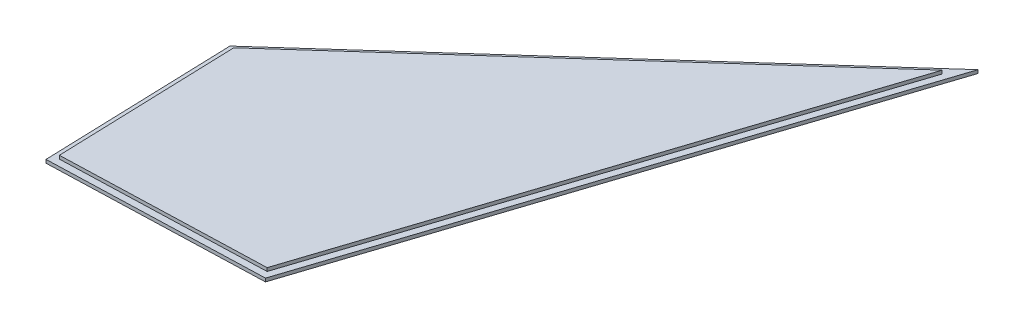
from build123d import *

# Parameters (mm, degrees)
BOSS_EXTRUDE1_DEPTH = 1
BOSS_EXTRUDE2_DEPTH = 1


with BuildPart() as part:
    # Sketch1 → Boss-Extrude1 (new body)
    with BuildSketch(Plane(origin=(0, 0, 0), x_dir=(1, 0, 0), z_dir=(0, 1, 0))):
        Polygon((55.848969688, 77.010858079), (-55.848969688, -23.106924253), (-54.088384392, -77.010858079), (6.062983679, -75.046221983), align=None)
    extrude(amount=BOSS_EXTRUDE1_DEPTH)

    # Sketch2 → Boss-Extrude2 (add)
    with BuildSketch(Plane.XZ):
        Polygon((60.072231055, -83.48209261), (7.527940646, 76.999440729), (-56.022030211, 79.075080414), (-57.878348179, 22.240094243), align=None)
    extrude(amount=BOSS_EXTRUDE2_DEPTH)


solid = part.part
